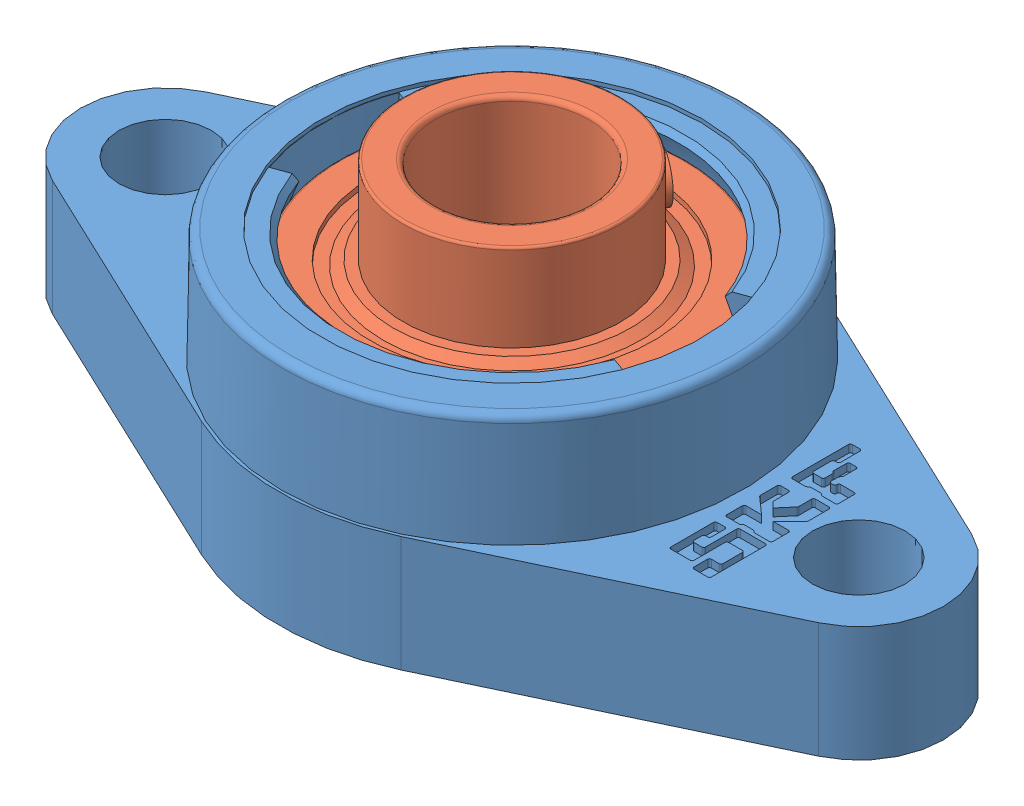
SolidWorks assembly FYTBK_20_TF_2_14a.SLDASM, configuration Default (file format 5000). Lengths in mm.
Overall size (112 37.3 60.5).
11 component instances, 4 part files, 7 mates.
Components (placement in the parent):
- 1-1: 1.sldprt [Default] at (-21.8615 19 24.5861) x (0 1 0) z (0 0 1) size (29.5 112 60.5)
- 2-1: 2.sldprt [Default] at (-21.8615 19 24.5861) x (0 1 0) z (0 0 1) size (31 47 47)
- 3-1: 3.sldprt [Default] at (-21.8615 22 24.5861) x (0 1 0) z (-0.00941 0 0.999956) (suppressed, hidden)
- Part23-1: Part23.SLDPRT [Default] at (-10.0174 19 -4.0079) x (0 1 0) z (0 0 1) size (7.94 7.94 7.94)
- Part23-2: Part23.SLDPRT [Default] at (6.7326 19 12.7421) x (0 1 0) z (-0.707107 0 0.707107) size (7.94 7.94 7.94)
- Part23-3: Part23.SLDPRT [Default] at (6.7326 19 36.4302) x (0 1 0) z (-1 0 0) size (7.94 7.94 7.94)
- Part23-4: Part23.SLDPRT [Default] at (-10.0174 19 53.1802) x (0 1 0) z (-0.707107 0 -0.707107) size (7.94 7.94 7.94)
- Part23-5: Part23.SLDPRT [Default] at (-33.7055 19 53.1802) x (0 1 0) z (0 0 -1) size (7.94 7.94 7.94)
- Part23-6: Part23.SLDPRT [Default] at (-50.4555 19 36.4302) x (0 1 0) z (0.707107 0 -0.707107) size (7.94 7.94 7.94)
- Part23-7: Part23.SLDPRT [Default] at (-50.4555 19 12.7421) x (0 1 0) z (1 0 0) size (7.94 7.94 7.94)
- Part23-8: Part23.SLDPRT [Default] at (-33.7055 19 -4.0079) x (0 1 0) z (0.707107 0 0.707107) size (7.94 7.94 7.94)
Mates (geometry in assembly coordinates):
- Coincident1: coincident aligned: line of 2-1 through (-21.8615 19 7.8361) axis (0 1 0); axis of Part23-1 through (-21.8615 16.2502 7.8361) axis (0 1 0)
- Coincident2: coincident aligned: line of 2-1 through (-21.8615 19 3.8671) axis (0 0 1); line of Part23-1 through (-21.8615 19 3.8671) axis (0 0 1)
- Concentric1: concentric anti-aligned: circle of 1-1; cylinder of 2-1 through (-21.8615 31.5 24.5861) axis (0 1 0) radius 14.1
- Distance1: distance = 37.3 mm anti-aligned: plane of 2-1 through (-34.0615 37.3 24.5861) normal (0 1 0); plane of 1-1 through (-21.8615 0 24.5861) normal (0 -1 0)
- Coincident4: coincident anti-aligned: plane of 1-1 through (-21.8615 0 24.5861) normal (0 -1 0); plane of assembly through (0 0 0) normal (0 1 0)
- Concentric2: concentric: cone of 1-1 through (-21.8615 15 24.5861) axis (0 1 0); cylinder of 3-1 through (-21.8615 30.75 24.5861) axis (0 1 0) radius 23.5
- Coincident5: coincident aligned: plane of 1-1 through (-45.3126 29 24.5861) normal (0 1 0); circle of 3-1
